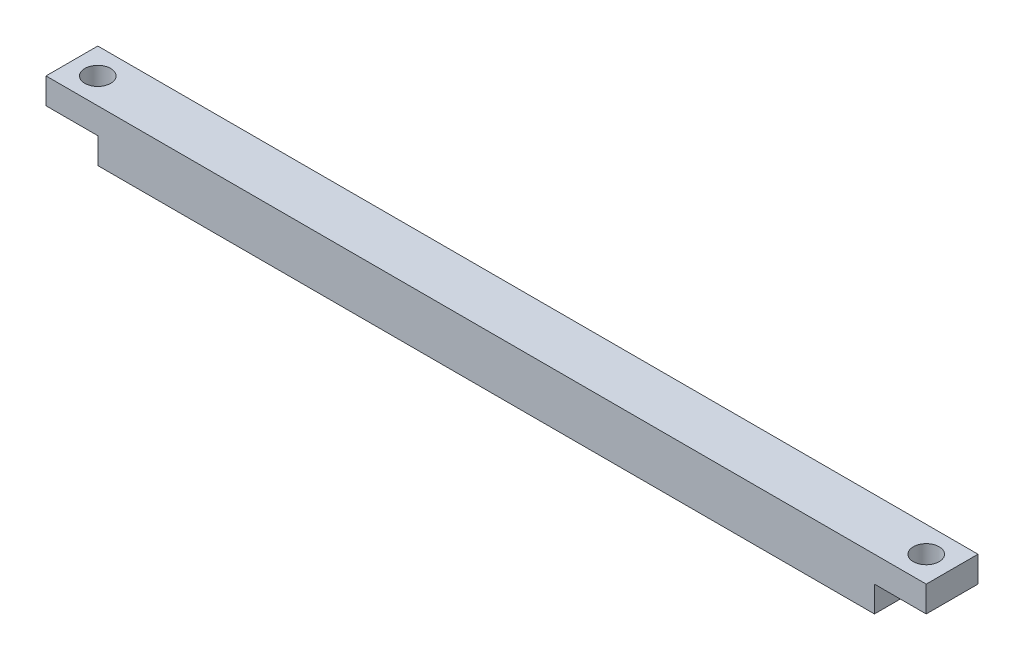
from build123d import *

# Parameters (mm, degrees)
BOSS_EXTRU_1_DEPTH      = 10
ESQUISSE5_R             = 2.5
ENL_V_MAT_EXTRU_6_DEPTH = 161.390149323


with BuildPart() as part:
    # Esquisse1 → Boss.-Extru.1 (new body)
    with BuildSketch(Plane.XY):
        Polygon((-160, 10), (-160, 5), (-150, 5), (-150, 0), (0, 0), (0, 5), (10, 5), (10, 10), align=None)
    extrude(amount=BOSS_EXTRU_1_DEPTH)

    # Esquisse5 → Enl_v. mat.-Extru.6 (cut, through all)
    with BuildSketch(Plane(origin=(0, 5, 0), x_dir=(-1, 0, 0), z_dir=(0, -1, 0))):
        with Locations(Location((155, -5, 0), (0, 0, 180))):
            Circle(ESQUISSE5_R)
        with Locations(Location((-5, -5, 0), (0, 0, 180))):
            Circle(ESQUISSE5_R)
    extrude(amount=-ENL_V_MAT_EXTRU_6_DEPTH, mode=Mode.SUBTRACT)


solid = part.part
